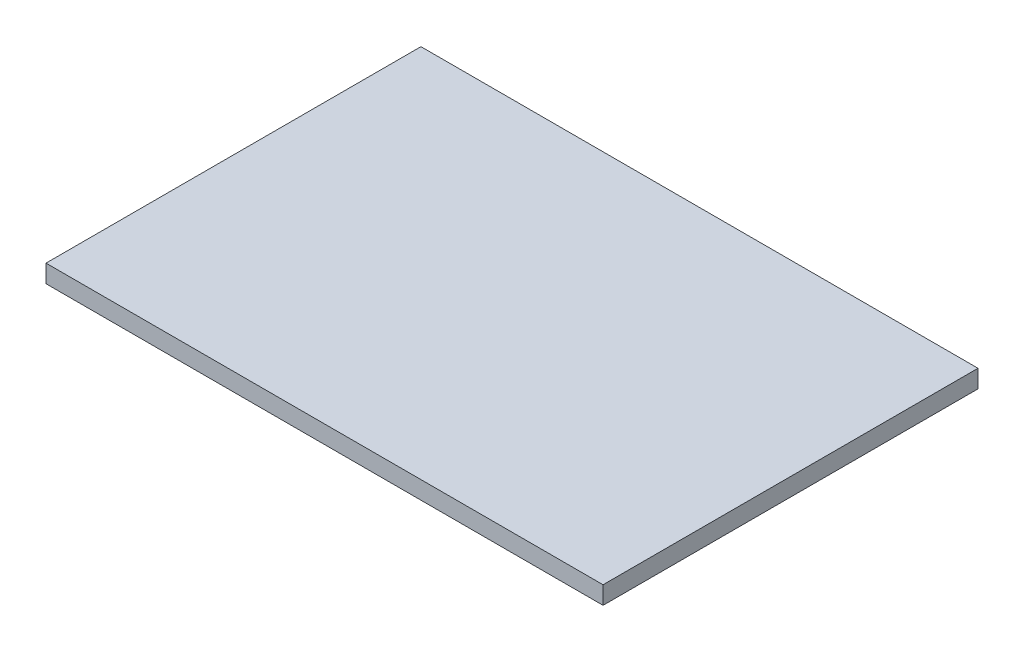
ISO-10303-21;
HEADER;
FILE_DESCRIPTION(('STEP AP214'),'2;1');
FILE_NAME('part.step','',(''),(''),'','','');
FILE_SCHEMA(('AUTOMOTIVE_DESIGN { 1 0 10303 214 1 1 1 1 }'));
ENDSEC;
DATA;
#1=APPLICATION_CONTEXT('core data for automotive mechanical design processes');
#2=APPLICATION_PROTOCOL_DEFINITION('international standard','automotive_design',2000,#1);
#3=PRODUCT_CONTEXT('',#1,'mechanical');
#4=PRODUCT('Part','Part','',(#3));
#5=PRODUCT_RELATED_PRODUCT_CATEGORY('part','',(#4));
#6=PRODUCT_DEFINITION_FORMATION('','',#4);
#7=PRODUCT_DEFINITION_CONTEXT('part definition',#1,'design');
#8=PRODUCT_DEFINITION('design','',#6,#7);
#9=PRODUCT_DEFINITION_SHAPE('','',#8);
#10=(LENGTH_UNIT() NAMED_UNIT(*) SI_UNIT(.MILLI.,.METRE.));
#11=(NAMED_UNIT(*) PLANE_ANGLE_UNIT() SI_UNIT($,.RADIAN.));
#12=(NAMED_UNIT(*) SI_UNIT($,.STERADIAN.) SOLID_ANGLE_UNIT());
#13=UNCERTAINTY_MEASURE_WITH_UNIT(LENGTH_MEASURE(1.E-05),#10,'distance_accuracy_value','');
#14=(GEOMETRIC_REPRESENTATION_CONTEXT(3) GLOBAL_UNCERTAINTY_ASSIGNED_CONTEXT((#13)) GLOBAL_UNIT_ASSIGNED_CONTEXT((#10,
#11,#12)) REPRESENTATION_CONTEXT('',''));
#15=CARTESIAN_POINT('',(0.,0.,0.));
#16=DIRECTION('',(0.,0.,1.));
#17=DIRECTION('',(1.,0.,0.));
#18=AXIS2_PLACEMENT_3D('',#15,#16,#17);
#19=CARTESIAN_POINT('',(205.844665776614,39.1997206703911,210.));
#20=DIRECTION('',(-1.,0.,0.));
#21=DIRECTION('',(0.,0.,1.));
#22=AXIS2_PLACEMENT_3D('',#19,#20,#21);
#23=PLANE('',#22);
#24=DIRECTION('',(0.,1.,0.));
#25=VECTOR('',#24,1.);
#26=CARTESIAN_POINT('',(205.844665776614,39.1997206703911,0.));
#27=LINE('',#26,#25);
#28=CARTESIAN_POINT('',(205.844665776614,39.1997206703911,0.));
#29=VERTEX_POINT('',#28);
#30=CARTESIAN_POINT('',(205.844665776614,49.1997206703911,0.));
#31=VERTEX_POINT('',#30);
#32=EDGE_CURVE('E95',#29,#31,#27,.T.);
#33=ORIENTED_EDGE('',*,*,#32,.T.);
#34=DIRECTION('',(0.,0.,-1.));
#35=VECTOR('',#34,1.);
#36=CARTESIAN_POINT('',(205.844665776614,49.1997206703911,210.));
#37=LINE('',#36,#35);
#38=CARTESIAN_POINT('',(205.844665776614,49.1997206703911,210.));
#39=VERTEX_POINT('',#38);
#40=EDGE_CURVE('E11',#39,#31,#37,.T.);
#41=ORIENTED_EDGE('',*,*,#40,.F.);
#42=DIRECTION('',(0.,1.,0.));
#43=VECTOR('',#42,1.);
#44=CARTESIAN_POINT('',(205.844665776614,39.1997206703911,210.));
#45=LINE('',#44,#43);
#46=CARTESIAN_POINT('',(205.844665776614,39.1997206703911,210.));
#47=VERTEX_POINT('',#46);
#48=EDGE_CURVE('E83',#47,#39,#45,.T.);
#49=ORIENTED_EDGE('',*,*,#48,.F.);
#50=DIRECTION('',(0.,0.,-1.));
#51=VECTOR('',#50,1.);
#52=CARTESIAN_POINT('',(205.844665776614,39.1997206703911,210.));
#53=LINE('',#52,#51);
#54=EDGE_CURVE('E91',#47,#29,#53,.T.);
#55=ORIENTED_EDGE('',*,*,#54,.T.);
#56=EDGE_LOOP('',(#33,#41,#49,#55));
#57=FACE_BOUND('',#56,.T.);
#58=ADVANCED_FACE('F32',(#57),#23,.F.);
#59=CARTESIAN_POINT('',(205.844665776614,49.1997206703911,210.));
#60=DIRECTION('',(0.,-1.,0.));
#61=DIRECTION('',(1.,0.,0.));
#62=AXIS2_PLACEMENT_3D('',#59,#60,#61);
#63=PLANE('',#62);
#64=DIRECTION('',(-1.,0.,0.));
#65=VECTOR('',#64,1.);
#66=CARTESIAN_POINT('',(205.844665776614,49.1997206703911,0.));
#67=LINE('',#66,#65);
#68=CARTESIAN_POINT('',(-106.155334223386,49.1997206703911,0.));
#69=VERTEX_POINT('',#68);
#70=EDGE_CURVE('E87',#31,#69,#67,.T.);
#71=ORIENTED_EDGE('',*,*,#70,.T.);
#72=DIRECTION('',(0.,0.,-1.));
#73=VECTOR('',#72,1.);
#74=CARTESIAN_POINT('',(-106.155334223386,49.1997206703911,210.));
#75=LINE('',#74,#73);
#76=CARTESIAN_POINT('',(-106.155334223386,49.1997206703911,210.));
#77=VERTEX_POINT('',#76);
#78=EDGE_CURVE('E40',#77,#69,#75,.T.);
#79=ORIENTED_EDGE('',*,*,#78,.F.);
#80=DIRECTION('',(-1.,0.,0.));
#81=VECTOR('',#80,1.);
#82=CARTESIAN_POINT('',(205.844665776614,49.1997206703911,210.));
#83=LINE('',#82,#81);
#84=EDGE_CURVE('E78',#39,#77,#83,.T.);
#85=ORIENTED_EDGE('',*,*,#84,.F.);
#86=ORIENTED_EDGE('',*,*,#40,.T.);
#87=EDGE_LOOP('',(#71,#79,#85,#86));
#88=FACE_BOUND('',#87,.T.);
#89=ADVANCED_FACE('F86',(#88),#63,.F.);
#90=CARTESIAN_POINT('',(-106.155334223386,39.1997206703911,210.));
#91=DIRECTION('',(1.,0.,0.));
#92=DIRECTION('',(0.,0.,-1.));
#93=AXIS2_PLACEMENT_3D('',#90,#91,#92);
#94=PLANE('',#93);
#95=DIRECTION('',(0.,-1.,0.));
#96=VECTOR('',#95,1.);
#97=CARTESIAN_POINT('',(-106.155334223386,39.1997206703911,0.));
#98=LINE('',#97,#96);
#99=CARTESIAN_POINT('',(-106.155334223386,39.1997206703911,0.));
#100=VERTEX_POINT('',#99);
#101=EDGE_CURVE('E65',#69,#100,#98,.T.);
#102=ORIENTED_EDGE('',*,*,#101,.T.);
#103=DIRECTION('',(0.,0.,-1.));
#104=VECTOR('',#103,1.);
#105=CARTESIAN_POINT('',(-106.155334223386,39.1997206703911,210.));
#106=LINE('',#105,#104);
#107=CARTESIAN_POINT('',(-106.155334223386,39.1997206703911,210.));
#108=VERTEX_POINT('',#107);
#109=EDGE_CURVE('E88',#108,#100,#106,.T.);
#110=ORIENTED_EDGE('',*,*,#109,.F.);
#111=DIRECTION('',(0.,-1.,0.));
#112=VECTOR('',#111,1.);
#113=CARTESIAN_POINT('',(-106.155334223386,39.1997206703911,210.));
#114=LINE('',#113,#112);
#115=EDGE_CURVE('E81',#77,#108,#114,.T.);
#116=ORIENTED_EDGE('',*,*,#115,.F.);
#117=ORIENTED_EDGE('',*,*,#78,.T.);
#118=EDGE_LOOP('',(#102,#110,#116,#117));
#119=FACE_BOUND('',#118,.T.);
#120=ADVANCED_FACE('F89',(#119),#94,.F.);
#121=CARTESIAN_POINT('',(205.844665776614,39.1997206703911,210.));
#122=DIRECTION('',(0.,1.,0.));
#123=DIRECTION('',(-1.,0.,0.));
#124=AXIS2_PLACEMENT_3D('',#121,#122,#123);
#125=PLANE('',#124);
#126=DIRECTION('',(1.,0.,0.));
#127=VECTOR('',#126,1.);
#128=CARTESIAN_POINT('',(205.844665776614,39.1997206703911,0.));
#129=LINE('',#128,#127);
#130=EDGE_CURVE('E71',#100,#29,#129,.T.);
#131=ORIENTED_EDGE('',*,*,#130,.T.);
#132=ORIENTED_EDGE('',*,*,#54,.F.);
#133=DIRECTION('',(1.,0.,0.));
#134=VECTOR('',#133,1.);
#135=CARTESIAN_POINT('',(205.844665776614,39.1997206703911,210.));
#136=LINE('',#135,#134);
#137=EDGE_CURVE('E48',#108,#47,#136,.T.);
#138=ORIENTED_EDGE('',*,*,#137,.F.);
#139=ORIENTED_EDGE('',*,*,#109,.T.);
#140=EDGE_LOOP('',(#131,#132,#138,#139));
#141=FACE_BOUND('',#140,.T.);
#142=ADVANCED_FACE('F102',(#141),#125,.F.);
#143=CARTESIAN_POINT('',(205.844665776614,49.1997206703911,210.));
#144=DIRECTION('',(0.,0.,1.));
#145=DIRECTION('',(1.,0.,0.));
#146=AXIS2_PLACEMENT_3D('',#143,#144,#145);
#147=PLANE('',#146);
#148=ORIENTED_EDGE('',*,*,#48,.T.);
#149=ORIENTED_EDGE('',*,*,#84,.T.);
#150=ORIENTED_EDGE('',*,*,#115,.T.);
#151=ORIENTED_EDGE('',*,*,#137,.T.);
#152=EDGE_LOOP('',(#148,#149,#150,#151));
#153=FACE_BOUND('',#152,.T.);
#154=ADVANCED_FACE('F79',(#153),#147,.T.);
#155=CARTESIAN_POINT('',(205.844665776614,49.1997206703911,0.));
#156=DIRECTION('',(0.,0.,1.));
#157=DIRECTION('',(1.,0.,0.));
#158=AXIS2_PLACEMENT_3D('',#155,#156,#157);
#159=PLANE('',#158);
#160=ORIENTED_EDGE('',*,*,#32,.F.);
#161=ORIENTED_EDGE('',*,*,#130,.F.);
#162=ORIENTED_EDGE('',*,*,#101,.F.);
#163=ORIENTED_EDGE('',*,*,#70,.F.);
#164=EDGE_LOOP('',(#160,#161,#162,#163));
#165=FACE_BOUND('',#164,.T.);
#166=ADVANCED_FACE('F105',(#165),#159,.F.);
#167=CLOSED_SHELL('',(#58,#89,#120,#142,#154,#166));
#168=MANIFOLD_SOLID_BREP('B2',#167);
#169=ADVANCED_BREP_SHAPE_REPRESENTATION('',(#18,#168),#14);
#170=SHAPE_DEFINITION_REPRESENTATION(#9,#169);
ENDSEC;
END-ISO-10303-21;
